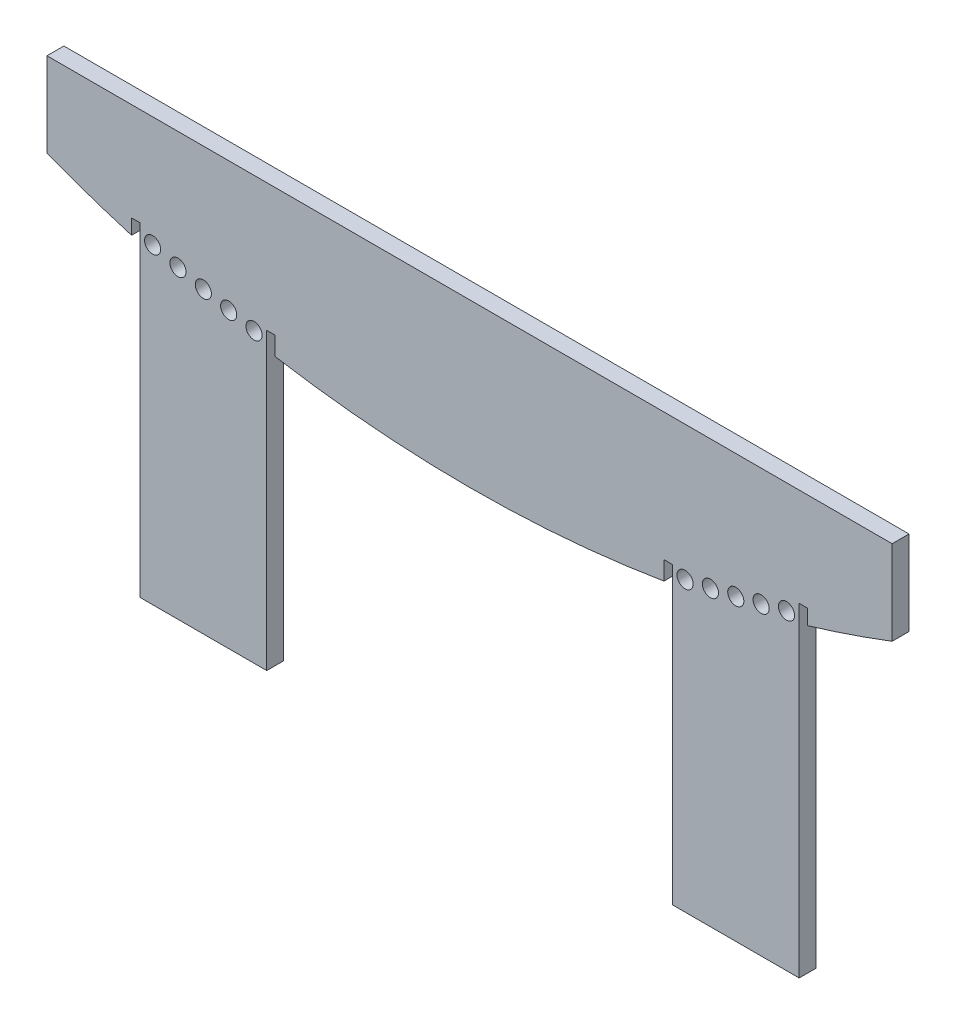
ISO-10303-21;
HEADER;
FILE_DESCRIPTION(('STEP AP214'),'2;1');
FILE_NAME('part.step','',(''),(''),'','','');
FILE_SCHEMA(('AUTOMOTIVE_DESIGN { 1 0 10303 214 1 1 1 1 }'));
ENDSEC;
DATA;
#1=APPLICATION_CONTEXT('core data for automotive mechanical design processes');
#2=APPLICATION_PROTOCOL_DEFINITION('international standard','automotive_design',2000,#1);
#3=PRODUCT_CONTEXT('',#1,'mechanical');
#4=PRODUCT('Part','Part','',(#3));
#5=PRODUCT_RELATED_PRODUCT_CATEGORY('part','',(#4));
#6=PRODUCT_DEFINITION_FORMATION('','',#4);
#7=PRODUCT_DEFINITION_CONTEXT('part definition',#1,'design');
#8=PRODUCT_DEFINITION('design','',#6,#7);
#9=PRODUCT_DEFINITION_SHAPE('','',#8);
#10=(LENGTH_UNIT() NAMED_UNIT(*) SI_UNIT(.MILLI.,.METRE.));
#11=(NAMED_UNIT(*) PLANE_ANGLE_UNIT() SI_UNIT($,.RADIAN.));
#12=(NAMED_UNIT(*) SI_UNIT($,.STERADIAN.) SOLID_ANGLE_UNIT());
#13=UNCERTAINTY_MEASURE_WITH_UNIT(LENGTH_MEASURE(1.E-05),#10,'distance_accuracy_value','');
#14=(GEOMETRIC_REPRESENTATION_CONTEXT(3) GLOBAL_UNCERTAINTY_ASSIGNED_CONTEXT((#13)) GLOBAL_UNIT_ASSIGNED_CONTEXT((#10,
#11,#12)) REPRESENTATION_CONTEXT('',''));
#15=CARTESIAN_POINT('',(0.,0.,0.));
#16=DIRECTION('',(0.,0.,1.));
#17=DIRECTION('',(1.,0.,0.));
#18=AXIS2_PLACEMENT_3D('',#15,#16,#17);
#19=CARTESIAN_POINT('',(0.,120.76696830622,2.));
#20=DIRECTION('',(0.,0.,1.));
#21=DIRECTION('',(1.,0.,0.));
#22=AXIS2_PLACEMENT_3D('',#19,#20,#21);
#23=PLANE('',#22);
#24=CARTESIAN_POINT('',(25.5,-15.9206317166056,2.));
#25=DIRECTION('',(0.,0.,1.));
#26=DIRECTION('',(1.,0.,0.));
#27=AXIS2_PLACEMENT_3D('',#24,#25,#26);
#28=CIRCLE('',#27,0.954144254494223);
#29=CARTESIAN_POINT('',(26.4541442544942,-15.9206317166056,2.));
#30=VERTEX_POINT('',#29);
#31=EDGE_CURVE('E657',#30,#30,#28,.T.);
#32=ORIENTED_EDGE('',*,*,#31,.F.);
#33=EDGE_LOOP('',(#32));
#34=FACE_BOUND('',#33,.T.);
#35=CARTESIAN_POINT('',(31.5,-14.6638258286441,2.));
#36=DIRECTION('',(0.,0.,1.));
#37=DIRECTION('',(1.,0.,0.));
#38=AXIS2_PLACEMENT_3D('',#35,#36,#37);
#39=CIRCLE('',#38,0.954144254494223);
#40=CARTESIAN_POINT('',(32.4541442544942,-14.6638258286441,2.));
#41=VERTEX_POINT('',#40);
#42=EDGE_CURVE('E672',#41,#41,#39,.T.);
#43=ORIENTED_EDGE('',*,*,#42,.F.);
#44=EDGE_LOOP('',(#43));
#45=FACE_BOUND('',#44,.T.);
#46=CARTESIAN_POINT('',(-28.5,-15.3267494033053,2.));
#47=DIRECTION('',(0.,0.,1.));
#48=DIRECTION('',(1.,0.,0.));
#49=AXIS2_PLACEMENT_3D('',#46,#47,#48);
#50=CIRCLE('',#49,0.954144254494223);
#51=CARTESIAN_POINT('',(-27.5458557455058,-15.3267494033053,2.));
#52=VERTEX_POINT('',#51);
#53=EDGE_CURVE('E684',#52,#52,#50,.T.);
#54=ORIENTED_EDGE('',*,*,#53,.F.);
#55=EDGE_LOOP('',(#54));
#56=FACE_BOUND('',#55,.T.);
#57=CARTESIAN_POINT('',(-34.5,-13.9308416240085,2.));
#58=DIRECTION('',(0.,0.,1.));
#59=DIRECTION('',(1.,0.,0.));
#60=AXIS2_PLACEMENT_3D('',#57,#58,#59);
#61=CIRCLE('',#60,0.954144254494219);
#62=CARTESIAN_POINT('',(-33.5458557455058,-13.9308416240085,2.));
#63=VERTEX_POINT('',#62);
#64=EDGE_CURVE('E696',#63,#63,#61,.T.);
#65=ORIENTED_EDGE('',*,*,#64,.F.);
#66=EDGE_LOOP('',(#65));
#67=FACE_BOUND('',#66,.T.);
#68=CARTESIAN_POINT('',(-37.5,-13.1266461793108,2.));
#69=DIRECTION('',(0.,0.,1.));
#70=DIRECTION('',(1.,0.,0.));
#71=AXIS2_PLACEMENT_3D('',#68,#69,#70);
#72=CIRCLE('',#71,0.954144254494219);
#73=CARTESIAN_POINT('',(-36.5458557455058,-13.1266461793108,2.));
#74=VERTEX_POINT('',#73);
#75=EDGE_CURVE('E708',#74,#74,#72,.T.);
#76=ORIENTED_EDGE('',*,*,#75,.F.);
#77=EDGE_LOOP('',(#76));
#78=FACE_BOUND('',#77,.T.);
#79=DIRECTION('',(-1.,0.,0.));
#80=VECTOR('',#79,1.);
#81=CARTESIAN_POINT('',(-24.,-15.1300515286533,2.));
#82=LINE('',#81,#80);
#83=CARTESIAN_POINT('',(-23.,-15.1300515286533,2.));
#84=VERTEX_POINT('',#83);
#85=CARTESIAN_POINT('',(-24.,-15.1300515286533,2.));
#86=VERTEX_POINT('',#85);
#87=EDGE_CURVE('E185',#84,#86,#82,.T.);
#88=ORIENTED_EDGE('',*,*,#87,.F.);
#89=DIRECTION('',(0.,1.,0.));
#90=VECTOR('',#89,1.);
#91=CARTESIAN_POINT('',(-23.,-50.,2.));
#92=LINE('',#91,#90);
#93=CARTESIAN_POINT('',(-23.,-17.3308231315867,2.));
#94=VERTEX_POINT('',#93);
#95=EDGE_CURVE('E201',#94,#84,#92,.T.);
#96=ORIENTED_EDGE('',*,*,#95,.F.);
#97=CARTESIAN_POINT('',(0.,120.76696830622,2.));
#98=DIRECTION('',(0.,0.,1.));
#99=DIRECTION('',(1.,0.,0.));
#100=AXIS2_PLACEMENT_3D('',#97,#98,#99);
#101=CIRCLE('',#100,140.);
#102=CARTESIAN_POINT('',(23.,-17.3308231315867,2.));
#103=VERTEX_POINT('',#102);
#104=EDGE_CURVE('E317',#94,#103,#101,.T.);
#105=ORIENTED_EDGE('',*,*,#104,.T.);
#106=DIRECTION('',(0.,-1.,0.));
#107=VECTOR('',#106,1.);
#108=CARTESIAN_POINT('',(23.,-15.1300515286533,2.));
#109=LINE('',#108,#107);
#110=CARTESIAN_POINT('',(23.,-15.1300515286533,2.));
#111=VERTEX_POINT('',#110);
#112=EDGE_CURVE('E253',#111,#103,#109,.T.);
#113=ORIENTED_EDGE('',*,*,#112,.F.);
#114=DIRECTION('',(-1.,0.,0.));
#115=VECTOR('',#114,1.);
#116=CARTESIAN_POINT('',(24.,-15.1300515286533,2.));
#117=LINE('',#116,#115);
#118=CARTESIAN_POINT('',(24.,-15.1300515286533,2.));
#119=VERTEX_POINT('',#118);
#120=EDGE_CURVE('E249',#119,#111,#117,.T.);
#121=ORIENTED_EDGE('',*,*,#120,.F.);
#122=DIRECTION('',(0.,-1.,0.));
#123=VECTOR('',#122,1.);
#124=CARTESIAN_POINT('',(24.,-15.1300515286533,2.));
#125=LINE('',#124,#123);
#126=CARTESIAN_POINT('',(24.,-50.,2.));
#127=VERTEX_POINT('',#126);
#128=EDGE_CURVE('E269',#119,#127,#125,.T.);
#129=ORIENTED_EDGE('',*,*,#128,.T.);
#130=DIRECTION('',(1.,0.,0.));
#131=VECTOR('',#130,1.);
#132=CARTESIAN_POINT('',(39.,-50.,2.));
#133=LINE('',#132,#131);
#134=CARTESIAN_POINT('',(39.,-50.,2.));
#135=VERTEX_POINT('',#134);
#136=EDGE_CURVE('E271',#127,#135,#133,.T.);
#137=ORIENTED_EDGE('',*,*,#136,.T.);
#138=DIRECTION('',(0.,1.,0.));
#139=VECTOR('',#138,1.);
#140=CARTESIAN_POINT('',(39.,-11.607500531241,2.));
#141=LINE('',#140,#139);
#142=CARTESIAN_POINT('',(39.,-11.607500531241,2.));
#143=VERTEX_POINT('',#142);
#144=EDGE_CURVE('E273',#135,#143,#141,.T.);
#145=ORIENTED_EDGE('',*,*,#144,.T.);
#146=DIRECTION('',(-1.,0.,0.));
#147=VECTOR('',#146,1.);
#148=CARTESIAN_POINT('',(40.,-11.607500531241,2.));
#149=LINE('',#148,#147);
#150=CARTESIAN_POINT('',(40.,-11.607500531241,2.));
#151=VERTEX_POINT('',#150);
#152=EDGE_CURVE('E237',#151,#143,#149,.T.);
#153=ORIENTED_EDGE('',*,*,#152,.F.);
#154=DIRECTION('',(0.,1.,0.));
#155=VECTOR('',#154,1.);
#156=CARTESIAN_POINT('',(40.,-50.,2.));
#157=LINE('',#156,#155);
#158=CARTESIAN_POINT('',(40.,-13.3971103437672,2.));
#159=VERTEX_POINT('',#158);
#160=EDGE_CURVE('E241',#159,#151,#157,.T.);
#161=ORIENTED_EDGE('',*,*,#160,.F.);
#162=CARTESIAN_POINT('',(49.9999999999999,-10.,2.));
#163=VERTEX_POINT('',#162);
#164=EDGE_CURVE('E312',#159,#163,#101,.T.);
#165=ORIENTED_EDGE('',*,*,#164,.T.);
#166=DIRECTION('',(0.,1.,0.));
#167=VECTOR('',#166,1.);
#168=CARTESIAN_POINT('',(50.,0.,2.));
#169=LINE('',#168,#167);
#170=CARTESIAN_POINT('',(50.,0.,2.));
#171=VERTEX_POINT('',#170);
#172=EDGE_CURVE('E304',#163,#171,#169,.T.);
#173=ORIENTED_EDGE('',*,*,#172,.T.);
#174=DIRECTION('',(-1.,0.,0.));
#175=VECTOR('',#174,1.);
#176=CARTESIAN_POINT('',(50.,0.,2.));
#177=LINE('',#176,#175);
#178=CARTESIAN_POINT('',(-50.,0.,2.));
#179=VERTEX_POINT('',#178);
#180=EDGE_CURVE('E308',#171,#179,#177,.T.);
#181=ORIENTED_EDGE('',*,*,#180,.T.);
#182=DIRECTION('',(0.,-1.,0.));
#183=VECTOR('',#182,1.);
#184=CARTESIAN_POINT('',(-50.,0.,2.));
#185=LINE('',#184,#183);
#186=CARTESIAN_POINT('',(-50.,-10.,2.));
#187=VERTEX_POINT('',#186);
#188=EDGE_CURVE('E310',#179,#187,#185,.T.);
#189=ORIENTED_EDGE('',*,*,#188,.T.);
#190=CARTESIAN_POINT('',(-40.,-13.3971103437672,2.));
#191=VERTEX_POINT('',#190);
#192=EDGE_CURVE('E313',#187,#191,#101,.T.);
#193=ORIENTED_EDGE('',*,*,#192,.T.);
#194=DIRECTION('',(0.,-1.,0.));
#195=VECTOR('',#194,1.);
#196=CARTESIAN_POINT('',(-40.,-11.607500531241,2.));
#197=LINE('',#196,#195);
#198=CARTESIAN_POINT('',(-40.,-11.607500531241,2.));
#199=VERTEX_POINT('',#198);
#200=EDGE_CURVE('E58',#199,#191,#197,.T.);
#201=ORIENTED_EDGE('',*,*,#200,.F.);
#202=DIRECTION('',(-1.,0.,0.));
#203=VECTOR('',#202,1.);
#204=CARTESIAN_POINT('',(-40.,-11.607500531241,2.));
#205=LINE('',#204,#203);
#206=CARTESIAN_POINT('',(-39.,-11.607500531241,2.));
#207=VERTEX_POINT('',#206);
#208=EDGE_CURVE('E221',#207,#199,#205,.T.);
#209=ORIENTED_EDGE('',*,*,#208,.F.);
#210=DIRECTION('',(0.,-1.,0.));
#211=VECTOR('',#210,1.);
#212=CARTESIAN_POINT('',(-39.,-11.607500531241,2.));
#213=LINE('',#212,#211);
#214=CARTESIAN_POINT('',(-39.,-50.,2.));
#215=VERTEX_POINT('',#214);
#216=EDGE_CURVE('E286',#207,#215,#213,.T.);
#217=ORIENTED_EDGE('',*,*,#216,.T.);
#218=DIRECTION('',(1.,0.,0.));
#219=VECTOR('',#218,1.);
#220=CARTESIAN_POINT('',(-39.,-50.,2.));
#221=LINE('',#220,#219);
#222=CARTESIAN_POINT('',(-24.,-50.,2.));
#223=VERTEX_POINT('',#222);
#224=EDGE_CURVE('E187',#215,#223,#221,.T.);
#225=ORIENTED_EDGE('',*,*,#224,.T.);
#226=DIRECTION('',(0.,1.,0.));
#227=VECTOR('',#226,1.);
#228=CARTESIAN_POINT('',(-24.,-15.1300515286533,2.));
#229=LINE('',#228,#227);
#230=EDGE_CURVE('E180',#223,#86,#229,.T.);
#231=ORIENTED_EDGE('',*,*,#230,.T.);
#232=EDGE_LOOP('',(#88,#96,#105,#113,#121,#129,#137,#145,#153,#161,#165,#173,#181,#189,#193,
#201,#209,#217,#225,#231));
#233=FACE_BOUND('',#232,.T.);
#234=CARTESIAN_POINT('',(-25.5,-15.9206317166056,2.));
#235=DIRECTION('',(0.,0.,1.));
#236=DIRECTION('',(1.,0.,0.));
#237=AXIS2_PLACEMENT_3D('',#234,#235,#236);
#238=CIRCLE('',#237,0.954144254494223);
#239=CARTESIAN_POINT('',(-24.5458557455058,-15.9206317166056,2.));
#240=VERTEX_POINT('',#239);
#241=EDGE_CURVE('E702',#240,#240,#238,.T.);
#242=ORIENTED_EDGE('',*,*,#241,.F.);
#243=EDGE_LOOP('',(#242));
#244=FACE_BOUND('',#243,.T.);
#245=CARTESIAN_POINT('',(-31.5,-14.6638258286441,2.));
#246=DIRECTION('',(0.,0.,1.));
#247=DIRECTION('',(1.,0.,0.));
#248=AXIS2_PLACEMENT_3D('',#245,#246,#247);
#249=CIRCLE('',#248,0.954144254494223);
#250=CARTESIAN_POINT('',(-30.5458557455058,-14.6638258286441,2.));
#251=VERTEX_POINT('',#250);
#252=EDGE_CURVE('E690',#251,#251,#249,.T.);
#253=ORIENTED_EDGE('',*,*,#252,.F.);
#254=EDGE_LOOP('',(#253));
#255=FACE_BOUND('',#254,.T.);
#256=CARTESIAN_POINT('',(28.5,-15.3267494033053,2.));
#257=DIRECTION('',(0.,0.,1.));
#258=DIRECTION('',(1.,0.,0.));
#259=AXIS2_PLACEMENT_3D('',#256,#257,#258);
#260=CIRCLE('',#259,0.954144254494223);
#261=CARTESIAN_POINT('',(29.4541442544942,-15.3267494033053,2.));
#262=VERTEX_POINT('',#261);
#263=EDGE_CURVE('E678',#262,#262,#260,.T.);
#264=ORIENTED_EDGE('',*,*,#263,.F.);
#265=EDGE_LOOP('',(#264));
#266=FACE_BOUND('',#265,.T.);
#267=CARTESIAN_POINT('',(34.5,-13.9308416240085,2.));
#268=DIRECTION('',(0.,0.,1.));
#269=DIRECTION('',(1.,0.,0.));
#270=AXIS2_PLACEMENT_3D('',#267,#268,#269);
#271=CIRCLE('',#270,0.954144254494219);
#272=CARTESIAN_POINT('',(35.4541442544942,-13.9308416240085,2.));
#273=VERTEX_POINT('',#272);
#274=EDGE_CURVE('E666',#273,#273,#271,.T.);
#275=ORIENTED_EDGE('',*,*,#274,.F.);
#276=EDGE_LOOP('',(#275));
#277=FACE_BOUND('',#276,.T.);
#278=CARTESIAN_POINT('',(37.5,-13.1266461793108,2.));
#279=DIRECTION('',(0.,0.,1.));
#280=DIRECTION('',(1.,0.,0.));
#281=AXIS2_PLACEMENT_3D('',#278,#279,#280);
#282=CIRCLE('',#281,0.954144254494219);
#283=CARTESIAN_POINT('',(38.4541442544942,-13.1266461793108,2.));
#284=VERTEX_POINT('',#283);
#285=EDGE_CURVE('E652',#284,#284,#282,.T.);
#286=ORIENTED_EDGE('',*,*,#285,.F.);
#287=EDGE_LOOP('',(#286));
#288=FACE_BOUND('',#287,.T.);
#289=ADVANCED_FACE('F43',(#34,#45,#56,#67,#78,#233,#244,#255,#266,#277,#288),#23,.T.);
#290=CARTESIAN_POINT('',(0.,120.76696830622,0.));
#291=DIRECTION('',(0.,0.,1.));
#292=DIRECTION('',(1.,0.,0.));
#293=AXIS2_PLACEMENT_3D('',#290,#291,#292);
#294=PLANE('',#293);
#295=CARTESIAN_POINT('',(25.5,-15.9206317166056,0.));
#296=DIRECTION('',(0.,0.,1.));
#297=DIRECTION('',(-1.,0.,0.));
#298=AXIS2_PLACEMENT_3D('',#295,#296,#297);
#299=CIRCLE('',#298,0.954144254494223);
#300=CARTESIAN_POINT('',(24.5458557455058,-15.9206317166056,0.));
#301=VERTEX_POINT('',#300);
#302=EDGE_CURVE('E654',#301,#301,#299,.T.);
#303=ORIENTED_EDGE('',*,*,#302,.T.);
#304=EDGE_LOOP('',(#303));
#305=FACE_BOUND('',#304,.T.);
#306=CARTESIAN_POINT('',(31.5,-14.6638258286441,0.));
#307=DIRECTION('',(0.,0.,1.));
#308=DIRECTION('',(-1.,0.,0.));
#309=AXIS2_PLACEMENT_3D('',#306,#307,#308);
#310=CIRCLE('',#309,0.954144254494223);
#311=CARTESIAN_POINT('',(30.5458557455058,-14.6638258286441,0.));
#312=VERTEX_POINT('',#311);
#313=EDGE_CURVE('E669',#312,#312,#310,.T.);
#314=ORIENTED_EDGE('',*,*,#313,.T.);
#315=EDGE_LOOP('',(#314));
#316=FACE_BOUND('',#315,.T.);
#317=CARTESIAN_POINT('',(-28.5,-15.3267494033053,0.));
#318=DIRECTION('',(0.,0.,1.));
#319=DIRECTION('',(1.,0.,0.));
#320=AXIS2_PLACEMENT_3D('',#317,#318,#319);
#321=CIRCLE('',#320,0.954144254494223);
#322=CARTESIAN_POINT('',(-27.5458557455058,-15.3267494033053,0.));
#323=VERTEX_POINT('',#322);
#324=EDGE_CURVE('E681',#323,#323,#321,.T.);
#325=ORIENTED_EDGE('',*,*,#324,.T.);
#326=EDGE_LOOP('',(#325));
#327=FACE_BOUND('',#326,.T.);
#328=CARTESIAN_POINT('',(-34.5,-13.9308416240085,0.));
#329=DIRECTION('',(0.,0.,1.));
#330=DIRECTION('',(1.,0.,0.));
#331=AXIS2_PLACEMENT_3D('',#328,#329,#330);
#332=CIRCLE('',#331,0.954144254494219);
#333=CARTESIAN_POINT('',(-33.5458557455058,-13.9308416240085,0.));
#334=VERTEX_POINT('',#333);
#335=EDGE_CURVE('E693',#334,#334,#332,.T.);
#336=ORIENTED_EDGE('',*,*,#335,.T.);
#337=EDGE_LOOP('',(#336));
#338=FACE_BOUND('',#337,.T.);
#339=CARTESIAN_POINT('',(-37.5,-13.1266461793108,0.));
#340=DIRECTION('',(0.,0.,1.));
#341=DIRECTION('',(1.,0.,0.));
#342=AXIS2_PLACEMENT_3D('',#339,#340,#341);
#343=CIRCLE('',#342,0.954144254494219);
#344=CARTESIAN_POINT('',(-36.5458557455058,-13.1266461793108,0.));
#345=VERTEX_POINT('',#344);
#346=EDGE_CURVE('E705',#345,#345,#343,.T.);
#347=ORIENTED_EDGE('',*,*,#346,.T.);
#348=EDGE_LOOP('',(#347));
#349=FACE_BOUND('',#348,.T.);
#350=DIRECTION('',(0.,1.,0.));
#351=VECTOR('',#350,1.);
#352=CARTESIAN_POINT('',(-23.,-50.,0.));
#353=LINE('',#352,#351);
#354=CARTESIAN_POINT('',(-23.,-17.3308231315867,0.));
#355=VERTEX_POINT('',#354);
#356=CARTESIAN_POINT('',(-23.,-15.1300515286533,0.));
#357=VERTEX_POINT('',#356);
#358=EDGE_CURVE('E214',#355,#357,#353,.T.);
#359=ORIENTED_EDGE('',*,*,#358,.T.);
#360=DIRECTION('',(-1.,0.,0.));
#361=VECTOR('',#360,1.);
#362=CARTESIAN_POINT('',(-24.,-15.1300515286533,0.));
#363=LINE('',#362,#361);
#364=CARTESIAN_POINT('',(-24.,-15.1300515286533,0.));
#365=VERTEX_POINT('',#364);
#366=EDGE_CURVE('E202',#357,#365,#363,.T.);
#367=ORIENTED_EDGE('',*,*,#366,.T.);
#368=DIRECTION('',(0.,1.,0.));
#369=VECTOR('',#368,1.);
#370=CARTESIAN_POINT('',(-24.,-15.1300515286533,0.));
#371=LINE('',#370,#369);
#372=CARTESIAN_POINT('',(-24.,-50.,0.));
#373=VERTEX_POINT('',#372);
#374=EDGE_CURVE('E197',#373,#365,#371,.T.);
#375=ORIENTED_EDGE('',*,*,#374,.F.);
#376=DIRECTION('',(1.,0.,0.));
#377=VECTOR('',#376,1.);
#378=CARTESIAN_POINT('',(-39.,-50.,0.));
#379=LINE('',#378,#377);
#380=CARTESIAN_POINT('',(-39.,-50.,0.));
#381=VERTEX_POINT('',#380);
#382=EDGE_CURVE('E283',#381,#373,#379,.T.);
#383=ORIENTED_EDGE('',*,*,#382,.F.);
#384=DIRECTION('',(0.,-1.,0.));
#385=VECTOR('',#384,1.);
#386=CARTESIAN_POINT('',(-39.,-11.607500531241,0.));
#387=LINE('',#386,#385);
#388=CARTESIAN_POINT('',(-39.,-11.607500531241,0.));
#389=VERTEX_POINT('',#388);
#390=EDGE_CURVE('E281',#389,#381,#387,.T.);
#391=ORIENTED_EDGE('',*,*,#390,.F.);
#392=DIRECTION('',(-1.,0.,0.));
#393=VECTOR('',#392,1.);
#394=CARTESIAN_POINT('',(-40.,-11.607500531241,0.));
#395=LINE('',#394,#393);
#396=CARTESIAN_POINT('',(-40.,-11.607500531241,0.));
#397=VERTEX_POINT('',#396);
#398=EDGE_CURVE('E210',#389,#397,#395,.T.);
#399=ORIENTED_EDGE('',*,*,#398,.T.);
#400=DIRECTION('',(0.,-1.,0.));
#401=VECTOR('',#400,1.);
#402=CARTESIAN_POINT('',(-40.,-11.607500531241,0.));
#403=LINE('',#402,#401);
#404=CARTESIAN_POINT('',(-40.,-13.3971103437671,0.));
#405=VERTEX_POINT('',#404);
#406=EDGE_CURVE('E218',#397,#405,#403,.T.);
#407=ORIENTED_EDGE('',*,*,#406,.T.);
#408=CARTESIAN_POINT('',(0.,120.76696830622,0.));
#409=DIRECTION('',(0.,0.,1.));
#410=DIRECTION('',(1.,0.,0.));
#411=AXIS2_PLACEMENT_3D('',#408,#409,#410);
#412=CIRCLE('',#411,140.);
#413=CARTESIAN_POINT('',(-50.,-10.,0.));
#414=VERTEX_POINT('',#413);
#415=EDGE_CURVE('E301',#414,#405,#412,.T.);
#416=ORIENTED_EDGE('',*,*,#415,.F.);
#417=DIRECTION('',(0.,-1.,0.));
#418=VECTOR('',#417,1.);
#419=CARTESIAN_POINT('',(-50.,0.,0.));
#420=LINE('',#419,#418);
#421=CARTESIAN_POINT('',(-50.,0.,0.));
#422=VERTEX_POINT('',#421);
#423=EDGE_CURVE('E298',#422,#414,#420,.T.);
#424=ORIENTED_EDGE('',*,*,#423,.F.);
#425=DIRECTION('',(-1.,0.,0.));
#426=VECTOR('',#425,1.);
#427=CARTESIAN_POINT('',(50.,0.,0.));
#428=LINE('',#427,#426);
#429=CARTESIAN_POINT('',(50.,0.,0.));
#430=VERTEX_POINT('',#429);
#431=EDGE_CURVE('E296',#430,#422,#428,.T.);
#432=ORIENTED_EDGE('',*,*,#431,.F.);
#433=DIRECTION('',(0.,1.,0.));
#434=VECTOR('',#433,1.);
#435=CARTESIAN_POINT('',(50.,0.,0.));
#436=LINE('',#435,#434);
#437=CARTESIAN_POINT('',(49.9999999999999,-10.,0.));
#438=VERTEX_POINT('',#437);
#439=EDGE_CURVE('E293',#438,#430,#436,.T.);
#440=ORIENTED_EDGE('',*,*,#439,.F.);
#441=CARTESIAN_POINT('',(40.,-13.3971103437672,0.));
#442=VERTEX_POINT('',#441);
#443=EDGE_CURVE('E300',#442,#438,#412,.T.);
#444=ORIENTED_EDGE('',*,*,#443,.F.);
#445=DIRECTION('',(0.,1.,0.));
#446=VECTOR('',#445,1.);
#447=CARTESIAN_POINT('',(40.,-50.,0.));
#448=LINE('',#447,#446);
#449=CARTESIAN_POINT('',(40.,-11.607500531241,0.));
#450=VERTEX_POINT('',#449);
#451=EDGE_CURVE('E226',#442,#450,#448,.T.);
#452=ORIENTED_EDGE('',*,*,#451,.T.);
#453=DIRECTION('',(-1.,0.,0.));
#454=VECTOR('',#453,1.);
#455=CARTESIAN_POINT('',(40.,-11.607500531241,0.));
#456=LINE('',#455,#454);
#457=CARTESIAN_POINT('',(39.,-11.607500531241,0.));
#458=VERTEX_POINT('',#457);
#459=EDGE_CURVE('E230',#450,#458,#456,.T.);
#460=ORIENTED_EDGE('',*,*,#459,.T.);
#461=DIRECTION('',(0.,1.,0.));
#462=VECTOR('',#461,1.);
#463=CARTESIAN_POINT('',(39.,-11.607500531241,0.));
#464=LINE('',#463,#462);
#465=CARTESIAN_POINT('',(39.,-50.,0.));
#466=VERTEX_POINT('',#465);
#467=EDGE_CURVE('E267',#466,#458,#464,.T.);
#468=ORIENTED_EDGE('',*,*,#467,.F.);
#469=DIRECTION('',(1.,0.,0.));
#470=VECTOR('',#469,1.);
#471=CARTESIAN_POINT('',(39.,-50.,0.));
#472=LINE('',#471,#470);
#473=CARTESIAN_POINT('',(24.,-50.,0.));
#474=VERTEX_POINT('',#473);
#475=EDGE_CURVE('E265',#474,#466,#472,.T.);
#476=ORIENTED_EDGE('',*,*,#475,.F.);
#477=DIRECTION('',(0.,-1.,0.));
#478=VECTOR('',#477,1.);
#479=CARTESIAN_POINT('',(24.,-15.1300515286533,0.));
#480=LINE('',#479,#478);
#481=CARTESIAN_POINT('',(24.,-15.1300515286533,0.));
#482=VERTEX_POINT('',#481);
#483=EDGE_CURVE('E66',#482,#474,#480,.T.);
#484=ORIENTED_EDGE('',*,*,#483,.F.);
#485=DIRECTION('',(-1.,0.,0.));
#486=VECTOR('',#485,1.);
#487=CARTESIAN_POINT('',(24.,-15.1300515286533,0.));
#488=LINE('',#487,#486);
#489=CARTESIAN_POINT('',(23.,-15.1300515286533,0.));
#490=VERTEX_POINT('',#489);
#491=EDGE_CURVE('E251',#482,#490,#488,.T.);
#492=ORIENTED_EDGE('',*,*,#491,.T.);
#493=DIRECTION('',(0.,-1.,0.));
#494=VECTOR('',#493,1.);
#495=CARTESIAN_POINT('',(23.,-15.1300515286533,0.));
#496=LINE('',#495,#494);
#497=CARTESIAN_POINT('',(23.,-17.3308231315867,0.));
#498=VERTEX_POINT('',#497);
#499=EDGE_CURVE('E246',#490,#498,#496,.T.);
#500=ORIENTED_EDGE('',*,*,#499,.T.);
#501=EDGE_CURVE('E305',#355,#498,#412,.T.);
#502=ORIENTED_EDGE('',*,*,#501,.F.);
#503=EDGE_LOOP('',(#359,#367,#375,#383,#391,#399,#407,#416,#424,#432,#440,#444,#452,#460,#468,
#476,#484,#492,#500,#502));
#504=FACE_BOUND('',#503,.T.);
#505=CARTESIAN_POINT('',(-25.5,-15.9206317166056,0.));
#506=DIRECTION('',(0.,0.,1.));
#507=DIRECTION('',(1.,0.,0.));
#508=AXIS2_PLACEMENT_3D('',#505,#506,#507);
#509=CIRCLE('',#508,0.954144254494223);
#510=CARTESIAN_POINT('',(-24.5458557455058,-15.9206317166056,0.));
#511=VERTEX_POINT('',#510);
#512=EDGE_CURVE('E699',#511,#511,#509,.T.);
#513=ORIENTED_EDGE('',*,*,#512,.T.);
#514=EDGE_LOOP('',(#513));
#515=FACE_BOUND('',#514,.T.);
#516=CARTESIAN_POINT('',(-31.5,-14.6638258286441,0.));
#517=DIRECTION('',(0.,0.,1.));
#518=DIRECTION('',(1.,0.,0.));
#519=AXIS2_PLACEMENT_3D('',#516,#517,#518);
#520=CIRCLE('',#519,0.954144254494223);
#521=CARTESIAN_POINT('',(-30.5458557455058,-14.6638258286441,0.));
#522=VERTEX_POINT('',#521);
#523=EDGE_CURVE('E687',#522,#522,#520,.T.);
#524=ORIENTED_EDGE('',*,*,#523,.T.);
#525=EDGE_LOOP('',(#524));
#526=FACE_BOUND('',#525,.T.);
#527=CARTESIAN_POINT('',(28.5,-15.3267494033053,0.));
#528=DIRECTION('',(0.,0.,1.));
#529=DIRECTION('',(-1.,0.,0.));
#530=AXIS2_PLACEMENT_3D('',#527,#528,#529);
#531=CIRCLE('',#530,0.954144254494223);
#532=CARTESIAN_POINT('',(27.5458557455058,-15.3267494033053,0.));
#533=VERTEX_POINT('',#532);
#534=EDGE_CURVE('E675',#533,#533,#531,.T.);
#535=ORIENTED_EDGE('',*,*,#534,.T.);
#536=EDGE_LOOP('',(#535));
#537=FACE_BOUND('',#536,.T.);
#538=CARTESIAN_POINT('',(34.5,-13.9308416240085,0.));
#539=DIRECTION('',(0.,0.,1.));
#540=DIRECTION('',(-1.,0.,0.));
#541=AXIS2_PLACEMENT_3D('',#538,#539,#540);
#542=CIRCLE('',#541,0.954144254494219);
#543=CARTESIAN_POINT('',(33.5458557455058,-13.9308416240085,0.));
#544=VERTEX_POINT('',#543);
#545=EDGE_CURVE('E663',#544,#544,#542,.T.);
#546=ORIENTED_EDGE('',*,*,#545,.T.);
#547=EDGE_LOOP('',(#546));
#548=FACE_BOUND('',#547,.T.);
#549=CARTESIAN_POINT('',(37.5,-13.1266461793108,0.));
#550=DIRECTION('',(0.,0.,1.));
#551=DIRECTION('',(-1.,0.,0.));
#552=AXIS2_PLACEMENT_3D('',#549,#550,#551);
#553=CIRCLE('',#552,0.954144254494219);
#554=CARTESIAN_POINT('',(36.5458557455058,-13.1266461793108,0.));
#555=VERTEX_POINT('',#554);
#556=EDGE_CURVE('E649',#555,#555,#553,.T.);
#557=ORIENTED_EDGE('',*,*,#556,.T.);
#558=EDGE_LOOP('',(#557));
#559=FACE_BOUND('',#558,.T.);
#560=ADVANCED_FACE('F336',(#305,#316,#327,#338,#349,#504,#515,#526,#537,#548,#559),#294,.F.);
#561=CARTESIAN_POINT('',(0.,120.76696830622,2.));
#562=DIRECTION('',(0.,0.,-1.));
#563=DIRECTION('',(-1.,0.,0.));
#564=AXIS2_PLACEMENT_3D('',#561,#562,#563);
#565=CYLINDRICAL_SURFACE('',#564,140.);
#566=DIRECTION('',(0.,0.,-1.));
#567=VECTOR('',#566,1.);
#568=CARTESIAN_POINT('',(-23.,-17.3308231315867,2.));
#569=LINE('',#568,#567);
#570=EDGE_CURVE('E12',#355,#94,#569,.F.);
#571=ORIENTED_EDGE('',*,*,#570,.F.);
#572=ORIENTED_EDGE('',*,*,#501,.T.);
#573=DIRECTION('',(0.,0.,-1.));
#574=VECTOR('',#573,1.);
#575=CARTESIAN_POINT('',(23.,-17.3308231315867,2.));
#576=LINE('',#575,#574);
#577=EDGE_CURVE('E256',#103,#498,#576,.T.);
#578=ORIENTED_EDGE('',*,*,#577,.F.);
#579=ORIENTED_EDGE('',*,*,#104,.F.);
#580=EDGE_LOOP('',(#571,#572,#578,#579));
#581=FACE_BOUND('',#580,.T.);
#582=ADVANCED_FACE('F362',(#581),#565,.T.);
#583=DIRECTION('',(0.,0.,-1.));
#584=VECTOR('',#583,1.);
#585=CARTESIAN_POINT('',(-40.,-13.3971103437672,2.));
#586=LINE('',#585,#584);
#587=EDGE_CURVE('E51',#191,#405,#586,.T.);
#588=ORIENTED_EDGE('',*,*,#587,.F.);
#589=ORIENTED_EDGE('',*,*,#192,.F.);
#590=DIRECTION('',(0.,0.,-1.));
#591=VECTOR('',#590,1.);
#592=CARTESIAN_POINT('',(-50.,-10.,2.));
#593=LINE('',#592,#591);
#594=EDGE_CURVE('E320',#187,#414,#593,.T.);
#595=ORIENTED_EDGE('',*,*,#594,.T.);
#596=ORIENTED_EDGE('',*,*,#415,.T.);
#597=EDGE_LOOP('',(#588,#589,#595,#596));
#598=FACE_BOUND('',#597,.T.);
#599=ADVANCED_FACE('F340',(#598),#565,.T.);
#600=DIRECTION('',(0.,0.,-1.));
#601=VECTOR('',#600,1.);
#602=CARTESIAN_POINT('',(40.,-13.3971103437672,2.));
#603=LINE('',#602,#601);
#604=EDGE_CURVE('E329',#442,#159,#603,.F.);
#605=ORIENTED_EDGE('',*,*,#604,.F.);
#606=ORIENTED_EDGE('',*,*,#443,.T.);
#607=DIRECTION('',(0.,0.,-1.));
#608=VECTOR('',#607,1.);
#609=CARTESIAN_POINT('',(49.9999999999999,-10.,2.));
#610=LINE('',#609,#608);
#611=EDGE_CURVE('E316',#163,#438,#610,.T.);
#612=ORIENTED_EDGE('',*,*,#611,.F.);
#613=ORIENTED_EDGE('',*,*,#164,.F.);
#614=EDGE_LOOP('',(#605,#606,#612,#613));
#615=FACE_BOUND('',#614,.T.);
#616=ADVANCED_FACE('F357',(#615),#565,.T.);
#617=CARTESIAN_POINT('',(50.,0.,2.));
#618=DIRECTION('',(-1.,0.,0.));
#619=DIRECTION('',(0.,-1.,0.));
#620=AXIS2_PLACEMENT_3D('',#617,#618,#619);
#621=PLANE('',#620);
#622=ORIENTED_EDGE('',*,*,#439,.T.);
#623=DIRECTION('',(0.,0.,-1.));
#624=VECTOR('',#623,1.);
#625=CARTESIAN_POINT('',(50.,0.,2.));
#626=LINE('',#625,#624);
#627=EDGE_CURVE('E326',#171,#430,#626,.T.);
#628=ORIENTED_EDGE('',*,*,#627,.F.);
#629=ORIENTED_EDGE('',*,*,#172,.F.);
#630=ORIENTED_EDGE('',*,*,#611,.T.);
#631=EDGE_LOOP('',(#622,#628,#629,#630));
#632=FACE_BOUND('',#631,.T.);
#633=ADVANCED_FACE('F45',(#632),#621,.F.);
#634=CARTESIAN_POINT('',(50.,0.,2.));
#635=DIRECTION('',(0.,-1.,0.));
#636=DIRECTION('',(0.,0.,-1.));
#637=AXIS2_PLACEMENT_3D('',#634,#635,#636);
#638=PLANE('',#637);
#639=ORIENTED_EDGE('',*,*,#431,.T.);
#640=DIRECTION('',(0.,0.,-1.));
#641=VECTOR('',#640,1.);
#642=CARTESIAN_POINT('',(-50.,0.,2.));
#643=LINE('',#642,#641);
#644=EDGE_CURVE('E323',#179,#422,#643,.T.);
#645=ORIENTED_EDGE('',*,*,#644,.F.);
#646=ORIENTED_EDGE('',*,*,#180,.F.);
#647=ORIENTED_EDGE('',*,*,#627,.T.);
#648=EDGE_LOOP('',(#639,#645,#646,#647));
#649=FACE_BOUND('',#648,.T.);
#650=ADVANCED_FACE('F350',(#649),#638,.F.);
#651=CARTESIAN_POINT('',(-50.,0.,2.));
#652=DIRECTION('',(1.,0.,0.));
#653=DIRECTION('',(0.,1.,0.));
#654=AXIS2_PLACEMENT_3D('',#651,#652,#653);
#655=PLANE('',#654);
#656=ORIENTED_EDGE('',*,*,#423,.T.);
#657=ORIENTED_EDGE('',*,*,#594,.F.);
#658=ORIENTED_EDGE('',*,*,#188,.F.);
#659=ORIENTED_EDGE('',*,*,#644,.T.);
#660=EDGE_LOOP('',(#656,#657,#658,#659));
#661=FACE_BOUND('',#660,.T.);
#662=ADVANCED_FACE('F344',(#661),#655,.F.);
#663=CARTESIAN_POINT('',(-39.,-11.607500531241,2.));
#664=DIRECTION('',(1.,0.,0.));
#665=DIRECTION('',(0.,1.,0.));
#666=AXIS2_PLACEMENT_3D('',#663,#664,#665);
#667=PLANE('',#666);
#668=ORIENTED_EDGE('',*,*,#216,.F.);
#669=DIRECTION('',(0.,0.,-1.));
#670=VECTOR('',#669,1.);
#671=CARTESIAN_POINT('',(-39.,-11.607500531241,40.4055206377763));
#672=LINE('',#671,#670);
#673=EDGE_CURVE('E207',#207,#389,#672,.T.);
#674=ORIENTED_EDGE('',*,*,#673,.T.);
#675=ORIENTED_EDGE('',*,*,#390,.T.);
#676=DIRECTION('',(0.,0.,-1.));
#677=VECTOR('',#676,1.);
#678=CARTESIAN_POINT('',(-39.,-50.,2.));
#679=LINE('',#678,#677);
#680=EDGE_CURVE('E290',#215,#381,#679,.T.);
#681=ORIENTED_EDGE('',*,*,#680,.F.);
#682=EDGE_LOOP('',(#668,#674,#675,#681));
#683=FACE_BOUND('',#682,.T.);
#684=ADVANCED_FACE('F416',(#683),#667,.F.);
#685=CARTESIAN_POINT('',(-24.,-15.1300515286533,2.));
#686=DIRECTION('',(-1.,0.,0.));
#687=DIRECTION('',(0.,-1.,0.));
#688=AXIS2_PLACEMENT_3D('',#685,#686,#687);
#689=PLANE('',#688);
#690=ORIENTED_EDGE('',*,*,#374,.T.);
#691=DIRECTION('',(0.,0.,-1.));
#692=VECTOR('',#691,1.);
#693=CARTESIAN_POINT('',(-24.,-15.1300515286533,40.4055206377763));
#694=LINE('',#693,#692);
#695=EDGE_CURVE('E194',#86,#365,#694,.T.);
#696=ORIENTED_EDGE('',*,*,#695,.F.);
#697=ORIENTED_EDGE('',*,*,#230,.F.);
#698=DIRECTION('',(0.,0.,-1.));
#699=VECTOR('',#698,1.);
#700=CARTESIAN_POINT('',(-24.,-50.,2.));
#701=LINE('',#700,#699);
#702=EDGE_CURVE('E191',#223,#373,#701,.T.);
#703=ORIENTED_EDGE('',*,*,#702,.T.);
#704=EDGE_LOOP('',(#690,#696,#697,#703));
#705=FACE_BOUND('',#704,.T.);
#706=ADVANCED_FACE('F195',(#705),#689,.F.);
#707=CARTESIAN_POINT('',(-39.,-50.,2.));
#708=DIRECTION('',(0.,1.,0.));
#709=DIRECTION('',(0.,0.,1.));
#710=AXIS2_PLACEMENT_3D('',#707,#708,#709);
#711=PLANE('',#710);
#712=ORIENTED_EDGE('',*,*,#382,.T.);
#713=ORIENTED_EDGE('',*,*,#702,.F.);
#714=ORIENTED_EDGE('',*,*,#224,.F.);
#715=ORIENTED_EDGE('',*,*,#680,.T.);
#716=EDGE_LOOP('',(#712,#713,#714,#715));
#717=FACE_BOUND('',#716,.T.);
#718=ADVANCED_FACE('F459',(#717),#711,.F.);
#719=CARTESIAN_POINT('',(24.,-15.1300515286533,2.));
#720=DIRECTION('',(1.,0.,0.));
#721=DIRECTION('',(0.,1.,0.));
#722=AXIS2_PLACEMENT_3D('',#719,#720,#721);
#723=PLANE('',#722);
#724=ORIENTED_EDGE('',*,*,#128,.F.);
#725=DIRECTION('',(0.,0.,-1.));
#726=VECTOR('',#725,1.);
#727=CARTESIAN_POINT('',(24.,-15.1300515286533,40.4055206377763));
#728=LINE('',#727,#726);
#729=EDGE_CURVE('E240',#119,#482,#728,.T.);
#730=ORIENTED_EDGE('',*,*,#729,.T.);
#731=ORIENTED_EDGE('',*,*,#483,.T.);
#732=DIRECTION('',(0.,0.,-1.));
#733=VECTOR('',#732,1.);
#734=CARTESIAN_POINT('',(24.,-50.,2.));
#735=LINE('',#734,#733);
#736=EDGE_CURVE('E278',#127,#474,#735,.T.);
#737=ORIENTED_EDGE('',*,*,#736,.F.);
#738=EDGE_LOOP('',(#724,#730,#731,#737));
#739=FACE_BOUND('',#738,.T.);
#740=ADVANCED_FACE('F373',(#739),#723,.F.);
#741=CARTESIAN_POINT('',(39.,-11.607500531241,2.));
#742=DIRECTION('',(-1.,0.,0.));
#743=DIRECTION('',(0.,-1.,0.));
#744=AXIS2_PLACEMENT_3D('',#741,#742,#743);
#745=PLANE('',#744);
#746=ORIENTED_EDGE('',*,*,#467,.T.);
#747=DIRECTION('',(0.,0.,-1.));
#748=VECTOR('',#747,1.);
#749=CARTESIAN_POINT('',(39.,-11.607500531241,40.4055206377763));
#750=LINE('',#749,#748);
#751=EDGE_CURVE('E233',#143,#458,#750,.T.);
#752=ORIENTED_EDGE('',*,*,#751,.F.);
#753=ORIENTED_EDGE('',*,*,#144,.F.);
#754=DIRECTION('',(0.,0.,-1.));
#755=VECTOR('',#754,1.);
#756=CARTESIAN_POINT('',(39.,-50.,2.));
#757=LINE('',#756,#755);
#758=EDGE_CURVE('E275',#135,#466,#757,.T.);
#759=ORIENTED_EDGE('',*,*,#758,.T.);
#760=EDGE_LOOP('',(#746,#752,#753,#759));
#761=FACE_BOUND('',#760,.T.);
#762=ADVANCED_FACE('F388',(#761),#745,.F.);
#763=CARTESIAN_POINT('',(39.,-50.,2.));
#764=DIRECTION('',(0.,1.,0.));
#765=DIRECTION('',(0.,0.,1.));
#766=AXIS2_PLACEMENT_3D('',#763,#764,#765);
#767=PLANE('',#766);
#768=ORIENTED_EDGE('',*,*,#475,.T.);
#769=ORIENTED_EDGE('',*,*,#758,.F.);
#770=ORIENTED_EDGE('',*,*,#136,.F.);
#771=ORIENTED_EDGE('',*,*,#736,.T.);
#772=EDGE_LOOP('',(#768,#769,#770,#771));
#773=FACE_BOUND('',#772,.T.);
#774=ADVANCED_FACE('F391',(#773),#767,.F.);
#775=CARTESIAN_POINT('',(23.,-15.1300515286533,40.4055206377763));
#776=DIRECTION('',(1.,0.,0.));
#777=DIRECTION('',(0.,0.,-1.));
#778=AXIS2_PLACEMENT_3D('',#775,#776,#777);
#779=PLANE('',#778);
#780=ORIENTED_EDGE('',*,*,#577,.T.);
#781=ORIENTED_EDGE('',*,*,#499,.F.);
#782=DIRECTION('',(0.,0.,-1.));
#783=VECTOR('',#782,1.);
#784=CARTESIAN_POINT('',(23.,-15.1300515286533,40.4055206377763));
#785=LINE('',#784,#783);
#786=EDGE_CURVE('E250',#111,#490,#785,.T.);
#787=ORIENTED_EDGE('',*,*,#786,.F.);
#788=ORIENTED_EDGE('',*,*,#112,.T.);
#789=EDGE_LOOP('',(#780,#781,#787,#788));
#790=FACE_BOUND('',#789,.T.);
#791=ADVANCED_FACE('F366',(#790),#779,.T.);
#792=CARTESIAN_POINT('',(24.,-15.1300515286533,40.4055206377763));
#793=DIRECTION('',(0.,-1.,0.));
#794=DIRECTION('',(0.,0.,-1.));
#795=AXIS2_PLACEMENT_3D('',#792,#793,#794);
#796=PLANE('',#795);
#797=ORIENTED_EDGE('',*,*,#120,.T.);
#798=ORIENTED_EDGE('',*,*,#786,.T.);
#799=ORIENTED_EDGE('',*,*,#491,.F.);
#800=ORIENTED_EDGE('',*,*,#729,.F.);
#801=EDGE_LOOP('',(#797,#798,#799,#800));
#802=FACE_BOUND('',#801,.T.);
#803=ADVANCED_FACE('F370',(#802),#796,.T.);
#804=CARTESIAN_POINT('',(40.,-50.,40.4055206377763));
#805=DIRECTION('',(-1.,0.,0.));
#806=DIRECTION('',(0.,0.,1.));
#807=AXIS2_PLACEMENT_3D('',#804,#805,#806);
#808=PLANE('',#807);
#809=ORIENTED_EDGE('',*,*,#604,.T.);
#810=ORIENTED_EDGE('',*,*,#160,.T.);
#811=DIRECTION('',(0.,0.,-1.));
#812=VECTOR('',#811,1.);
#813=CARTESIAN_POINT('',(40.,-11.607500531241,40.4055206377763));
#814=LINE('',#813,#812);
#815=EDGE_CURVE('E234',#151,#450,#814,.T.);
#816=ORIENTED_EDGE('',*,*,#815,.T.);
#817=ORIENTED_EDGE('',*,*,#451,.F.);
#818=EDGE_LOOP('',(#809,#810,#816,#817));
#819=FACE_BOUND('',#818,.T.);
#820=ADVANCED_FACE('F381',(#819),#808,.T.);
#821=CARTESIAN_POINT('',(40.,-11.607500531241,40.4055206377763));
#822=DIRECTION('',(0.,-1.,0.));
#823=DIRECTION('',(0.,0.,-1.));
#824=AXIS2_PLACEMENT_3D('',#821,#822,#823);
#825=PLANE('',#824);
#826=ORIENTED_EDGE('',*,*,#152,.T.);
#827=ORIENTED_EDGE('',*,*,#751,.T.);
#828=ORIENTED_EDGE('',*,*,#459,.F.);
#829=ORIENTED_EDGE('',*,*,#815,.F.);
#830=EDGE_LOOP('',(#826,#827,#828,#829));
#831=FACE_BOUND('',#830,.T.);
#832=ADVANCED_FACE('F384',(#831),#825,.T.);
#833=CARTESIAN_POINT('',(-40.,-11.607500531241,40.4055206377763));
#834=DIRECTION('',(1.,0.,0.));
#835=DIRECTION('',(0.,0.,-1.));
#836=AXIS2_PLACEMENT_3D('',#833,#834,#835);
#837=PLANE('',#836);
#838=ORIENTED_EDGE('',*,*,#587,.T.);
#839=ORIENTED_EDGE('',*,*,#406,.F.);
#840=DIRECTION('',(0.,0.,-1.));
#841=VECTOR('',#840,1.);
#842=CARTESIAN_POINT('',(-40.,-11.607500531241,40.4055206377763));
#843=LINE('',#842,#841);
#844=EDGE_CURVE('E222',#199,#397,#843,.T.);
#845=ORIENTED_EDGE('',*,*,#844,.F.);
#846=ORIENTED_EDGE('',*,*,#200,.T.);
#847=EDGE_LOOP('',(#838,#839,#845,#846));
#848=FACE_BOUND('',#847,.T.);
#849=ADVANCED_FACE('F331',(#848),#837,.T.);
#850=CARTESIAN_POINT('',(-40.,-11.607500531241,40.4055206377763));
#851=DIRECTION('',(0.,-1.,0.));
#852=DIRECTION('',(0.,0.,-1.));
#853=AXIS2_PLACEMENT_3D('',#850,#851,#852);
#854=PLANE('',#853);
#855=ORIENTED_EDGE('',*,*,#208,.T.);
#856=ORIENTED_EDGE('',*,*,#844,.T.);
#857=ORIENTED_EDGE('',*,*,#398,.F.);
#858=ORIENTED_EDGE('',*,*,#673,.F.);
#859=EDGE_LOOP('',(#855,#856,#857,#858));
#860=FACE_BOUND('',#859,.T.);
#861=ADVANCED_FACE('F515',(#860),#854,.T.);
#862=CARTESIAN_POINT('',(-23.,-50.,40.4055206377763));
#863=DIRECTION('',(-1.,0.,0.));
#864=DIRECTION('',(0.,0.,1.));
#865=AXIS2_PLACEMENT_3D('',#862,#863,#864);
#866=PLANE('',#865);
#867=ORIENTED_EDGE('',*,*,#570,.T.);
#868=ORIENTED_EDGE('',*,*,#95,.T.);
#869=DIRECTION('',(0.,0.,-1.));
#870=VECTOR('',#869,1.);
#871=CARTESIAN_POINT('',(-23.,-15.1300515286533,40.4055206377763));
#872=LINE('',#871,#870);
#873=EDGE_CURVE('E206',#84,#357,#872,.T.);
#874=ORIENTED_EDGE('',*,*,#873,.T.);
#875=ORIENTED_EDGE('',*,*,#358,.F.);
#876=EDGE_LOOP('',(#867,#868,#874,#875));
#877=FACE_BOUND('',#876,.T.);
#878=ADVANCED_FACE('F524',(#877),#866,.T.);
#879=CARTESIAN_POINT('',(-24.,-15.1300515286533,40.4055206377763));
#880=DIRECTION('',(0.,-1.,0.));
#881=DIRECTION('',(0.,0.,-1.));
#882=AXIS2_PLACEMENT_3D('',#879,#880,#881);
#883=PLANE('',#882);
#884=ORIENTED_EDGE('',*,*,#87,.T.);
#885=ORIENTED_EDGE('',*,*,#695,.T.);
#886=ORIENTED_EDGE('',*,*,#366,.F.);
#887=ORIENTED_EDGE('',*,*,#873,.F.);
#888=EDGE_LOOP('',(#884,#885,#886,#887));
#889=FACE_BOUND('',#888,.T.);
#890=ADVANCED_FACE('F205',(#889),#883,.T.);
#891=CARTESIAN_POINT('',(-37.5,-13.1266461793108,40.4055206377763));
#892=DIRECTION('',(0.,0.,-1.));
#893=DIRECTION('',(-1.,0.,0.));
#894=AXIS2_PLACEMENT_3D('',#891,#892,#893);
#895=CYLINDRICAL_SURFACE('',#894,0.954144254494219);
#896=ORIENTED_EDGE('',*,*,#346,.F.);
#897=EDGE_LOOP('',(#896));
#898=FACE_BOUND('',#897,.T.);
#899=ORIENTED_EDGE('',*,*,#75,.T.);
#900=EDGE_LOOP('',(#899));
#901=FACE_BOUND('',#900,.T.);
#902=ADVANCED_FACE('F543',(#898,#901),#895,.F.);
#903=CARTESIAN_POINT('',(-25.5,-15.9206317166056,40.4055206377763));
#904=DIRECTION('',(0.,0.,-1.));
#905=DIRECTION('',(-1.,0.,0.));
#906=AXIS2_PLACEMENT_3D('',#903,#904,#905);
#907=CYLINDRICAL_SURFACE('',#906,0.954144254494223);
#908=ORIENTED_EDGE('',*,*,#512,.F.);
#909=EDGE_LOOP('',(#908));
#910=FACE_BOUND('',#909,.T.);
#911=ORIENTED_EDGE('',*,*,#241,.T.);
#912=EDGE_LOOP('',(#911));
#913=FACE_BOUND('',#912,.T.);
#914=ADVANCED_FACE('F552',(#910,#913),#907,.F.);
#915=CARTESIAN_POINT('',(-34.5,-13.9308416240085,40.4055206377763));
#916=DIRECTION('',(0.,0.,-1.));
#917=DIRECTION('',(-1.,0.,0.));
#918=AXIS2_PLACEMENT_3D('',#915,#916,#917);
#919=CYLINDRICAL_SURFACE('',#918,0.954144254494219);
#920=ORIENTED_EDGE('',*,*,#335,.F.);
#921=EDGE_LOOP('',(#920));
#922=FACE_BOUND('',#921,.T.);
#923=ORIENTED_EDGE('',*,*,#64,.T.);
#924=EDGE_LOOP('',(#923));
#925=FACE_BOUND('',#924,.T.);
#926=ADVANCED_FACE('F562',(#922,#925),#919,.F.);
#927=CARTESIAN_POINT('',(-31.5,-14.6638258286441,40.4055206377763));
#928=DIRECTION('',(0.,0.,-1.));
#929=DIRECTION('',(-1.,0.,0.));
#930=AXIS2_PLACEMENT_3D('',#927,#928,#929);
#931=CYLINDRICAL_SURFACE('',#930,0.954144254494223);
#932=ORIENTED_EDGE('',*,*,#523,.F.);
#933=EDGE_LOOP('',(#932));
#934=FACE_BOUND('',#933,.T.);
#935=ORIENTED_EDGE('',*,*,#252,.T.);
#936=EDGE_LOOP('',(#935));
#937=FACE_BOUND('',#936,.T.);
#938=ADVANCED_FACE('F572',(#934,#937),#931,.F.);
#939=CARTESIAN_POINT('',(-28.5,-15.3267494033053,40.4055206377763));
#940=DIRECTION('',(0.,0.,-1.));
#941=DIRECTION('',(-1.,0.,0.));
#942=AXIS2_PLACEMENT_3D('',#939,#940,#941);
#943=CYLINDRICAL_SURFACE('',#942,0.954144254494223);
#944=ORIENTED_EDGE('',*,*,#324,.F.);
#945=EDGE_LOOP('',(#944));
#946=FACE_BOUND('',#945,.T.);
#947=ORIENTED_EDGE('',*,*,#53,.T.);
#948=EDGE_LOOP('',(#947));
#949=FACE_BOUND('',#948,.T.);
#950=ADVANCED_FACE('F582',(#946,#949),#943,.F.);
#951=CARTESIAN_POINT('',(28.5,-15.3267494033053,40.4055206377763));
#952=DIRECTION('',(0.,0.,-1.));
#953=DIRECTION('',(-1.,0.,0.));
#954=AXIS2_PLACEMENT_3D('',#951,#952,#953);
#955=CYLINDRICAL_SURFACE('',#954,0.954144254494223);
#956=ORIENTED_EDGE('',*,*,#534,.F.);
#957=EDGE_LOOP('',(#956));
#958=FACE_BOUND('',#957,.T.);
#959=ORIENTED_EDGE('',*,*,#263,.T.);
#960=EDGE_LOOP('',(#959));
#961=FACE_BOUND('',#960,.T.);
#962=ADVANCED_FACE('F592',(#958,#961),#955,.F.);
#963=CARTESIAN_POINT('',(31.5,-14.6638258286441,40.4055206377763));
#964=DIRECTION('',(0.,0.,-1.));
#965=DIRECTION('',(-1.,0.,0.));
#966=AXIS2_PLACEMENT_3D('',#963,#964,#965);
#967=CYLINDRICAL_SURFACE('',#966,0.954144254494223);
#968=ORIENTED_EDGE('',*,*,#313,.F.);
#969=EDGE_LOOP('',(#968));
#970=FACE_BOUND('',#969,.T.);
#971=ORIENTED_EDGE('',*,*,#42,.T.);
#972=EDGE_LOOP('',(#971));
#973=FACE_BOUND('',#972,.T.);
#974=ADVANCED_FACE('F602',(#970,#973),#967,.F.);
#975=CARTESIAN_POINT('',(34.5,-13.9308416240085,40.4055206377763));
#976=DIRECTION('',(0.,0.,-1.));
#977=DIRECTION('',(-1.,0.,0.));
#978=AXIS2_PLACEMENT_3D('',#975,#976,#977);
#979=CYLINDRICAL_SURFACE('',#978,0.954144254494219);
#980=ORIENTED_EDGE('',*,*,#545,.F.);
#981=EDGE_LOOP('',(#980));
#982=FACE_BOUND('',#981,.T.);
#983=ORIENTED_EDGE('',*,*,#274,.T.);
#984=EDGE_LOOP('',(#983));
#985=FACE_BOUND('',#984,.T.);
#986=ADVANCED_FACE('F612',(#982,#985),#979,.F.);
#987=CARTESIAN_POINT('',(25.5,-15.9206317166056,40.4055206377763));
#988=DIRECTION('',(0.,0.,-1.));
#989=DIRECTION('',(-1.,0.,0.));
#990=AXIS2_PLACEMENT_3D('',#987,#988,#989);
#991=CYLINDRICAL_SURFACE('',#990,0.954144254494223);
#992=ORIENTED_EDGE('',*,*,#302,.F.);
#993=EDGE_LOOP('',(#992));
#994=FACE_BOUND('',#993,.T.);
#995=ORIENTED_EDGE('',*,*,#31,.T.);
#996=EDGE_LOOP('',(#995));
#997=FACE_BOUND('',#996,.T.);
#998=ADVANCED_FACE('F622',(#994,#997),#991,.F.);
#999=CARTESIAN_POINT('',(37.5,-13.1266461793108,40.4055206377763));
#1000=DIRECTION('',(0.,0.,-1.));
#1001=DIRECTION('',(-1.,0.,0.));
#1002=AXIS2_PLACEMENT_3D('',#999,#1000,#1001);
#1003=CYLINDRICAL_SURFACE('',#1002,0.954144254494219);
#1004=ORIENTED_EDGE('',*,*,#556,.F.);
#1005=EDGE_LOOP('',(#1004));
#1006=FACE_BOUND('',#1005,.T.);
#1007=ORIENTED_EDGE('',*,*,#285,.T.);
#1008=EDGE_LOOP('',(#1007));
#1009=FACE_BOUND('',#1008,.T.);
#1010=ADVANCED_FACE('F632',(#1006,#1009),#1003,.F.);
#1011=CLOSED_SHELL('',(#289,#560,#582,#599,#616,#633,#650,#662,#684,#706,#718,#740,#762,#774,
#791,#803,#820,#832,#849,#861,#878,#890,#902,#914,#926,#938,#950,#962,#974,#986,#998,#1010));
#1012=MANIFOLD_SOLID_BREP('B2',#1011);
#1013=ADVANCED_BREP_SHAPE_REPRESENTATION('',(#18,#1012),#14);
#1014=SHAPE_DEFINITION_REPRESENTATION(#9,#1013);
ENDSEC;
END-ISO-10303-21;
